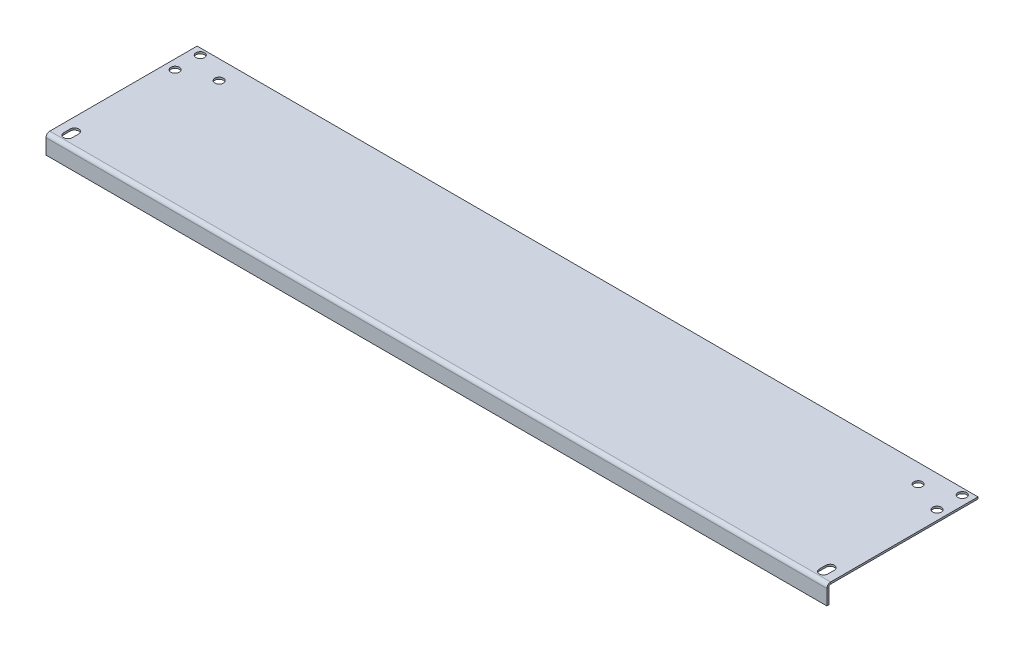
ISO-10303-21;
HEADER;
FILE_DESCRIPTION(('STEP AP214'),'2;1');
FILE_NAME('part.step','',(''),(''),'','','');
FILE_SCHEMA(('AUTOMOTIVE_DESIGN { 1 0 10303 214 1 1 1 1 }'));
ENDSEC;
DATA;
#1=APPLICATION_CONTEXT('core data for automotive mechanical design processes');
#2=APPLICATION_PROTOCOL_DEFINITION('international standard','automotive_design',2000,#1);
#3=PRODUCT_CONTEXT('',#1,'mechanical');
#4=PRODUCT('Part','Part','',(#3));
#5=PRODUCT_RELATED_PRODUCT_CATEGORY('part','',(#4));
#6=PRODUCT_DEFINITION_FORMATION('','',#4);
#7=PRODUCT_DEFINITION_CONTEXT('part definition',#1,'design');
#8=PRODUCT_DEFINITION('design','',#6,#7);
#9=PRODUCT_DEFINITION_SHAPE('','',#8);
#10=(LENGTH_UNIT() NAMED_UNIT(*) SI_UNIT(.MILLI.,.METRE.));
#11=(NAMED_UNIT(*) PLANE_ANGLE_UNIT() SI_UNIT($,.RADIAN.));
#12=(NAMED_UNIT(*) SI_UNIT($,.STERADIAN.) SOLID_ANGLE_UNIT());
#13=UNCERTAINTY_MEASURE_WITH_UNIT(LENGTH_MEASURE(1.E-05),#10,'distance_accuracy_value','');
#14=(GEOMETRIC_REPRESENTATION_CONTEXT(3) GLOBAL_UNCERTAINTY_ASSIGNED_CONTEXT((#13)) GLOBAL_UNIT_ASSIGNED_CONTEXT((#10,
#11,#12)) REPRESENTATION_CONTEXT('',''));
#15=CARTESIAN_POINT('',(0.,0.,0.));
#16=DIRECTION('',(0.,0.,1.));
#17=DIRECTION('',(1.,0.,0.));
#18=AXIS2_PLACEMENT_3D('',#15,#16,#17);
#19=CARTESIAN_POINT('',(310.,-1.5,0.));
#20=DIRECTION('',(0.,1.,0.));
#21=DIRECTION('',(0.,0.,1.));
#22=AXIS2_PLACEMENT_3D('',#19,#20,#21);
#23=PLANE('',#22);
#24=CARTESIAN_POINT('',(-302.5,-1.5,-115.));
#25=DIRECTION('',(0.,1.,0.));
#26=DIRECTION('',(0.,0.,1.));
#27=AXIS2_PLACEMENT_3D('',#24,#25,#26);
#28=CIRCLE('',#27,3.39999999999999);
#29=CARTESIAN_POINT('',(-302.5,-1.5,-111.6));
#30=VERTEX_POINT('',#29);
#31=EDGE_CURVE('E498',#30,#30,#28,.T.);
#32=ORIENTED_EDGE('',*,*,#31,.T.);
#33=EDGE_LOOP('',(#32));
#34=FACE_BOUND('',#33,.T.);
#35=CARTESIAN_POINT('',(-302.5,-1.5,-95.));
#36=DIRECTION('',(0.,1.,0.));
#37=DIRECTION('',(0.,0.,1.));
#38=AXIS2_PLACEMENT_3D('',#35,#36,#37);
#39=CIRCLE('',#38,3.39999999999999);
#40=CARTESIAN_POINT('',(-302.5,-1.5,-91.6));
#41=VERTEX_POINT('',#40);
#42=EDGE_CURVE('E505',#41,#41,#39,.T.);
#43=ORIENTED_EDGE('',*,*,#42,.T.);
#44=EDGE_LOOP('',(#43));
#45=FACE_BOUND('',#44,.T.);
#46=CARTESIAN_POINT('',(-277.5,-1.5,-105.));
#47=DIRECTION('',(0.,1.,0.));
#48=DIRECTION('',(0.,0.,1.));
#49=AXIS2_PLACEMENT_3D('',#46,#47,#48);
#50=CIRCLE('',#49,3.39999999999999);
#51=CARTESIAN_POINT('',(-277.5,-1.5,-101.6));
#52=VERTEX_POINT('',#51);
#53=EDGE_CURVE('E517',#52,#52,#50,.T.);
#54=ORIENTED_EDGE('',*,*,#53,.T.);
#55=EDGE_LOOP('',(#54));
#56=FACE_BOUND('',#55,.T.);
#57=DIRECTION('',(0.,0.,-1.));
#58=VECTOR('',#57,1.);
#59=CARTESIAN_POINT('',(-310.,-1.5,0.));
#60=LINE('',#59,#58);
#61=CARTESIAN_POINT('',(-310.,-1.5,-3.));
#62=VERTEX_POINT('',#61);
#63=CARTESIAN_POINT('',(-310.,-1.5,-120.));
#64=VERTEX_POINT('',#63);
#65=EDGE_CURVE('E262',#62,#64,#60,.T.);
#66=ORIENTED_EDGE('',*,*,#65,.T.);
#67=DIRECTION('',(-1.,0.,0.));
#68=VECTOR('',#67,1.);
#69=CARTESIAN_POINT('',(310.,-1.5,-120.));
#70=LINE('',#69,#68);
#71=CARTESIAN_POINT('',(310.,-1.5,-120.));
#72=VERTEX_POINT('',#71);
#73=EDGE_CURVE('E349',#72,#64,#70,.T.);
#74=ORIENTED_EDGE('',*,*,#73,.F.);
#75=DIRECTION('',(0.,0.,-1.));
#76=VECTOR('',#75,1.);
#77=CARTESIAN_POINT('',(310.,-1.5,0.));
#78=LINE('',#77,#76);
#79=CARTESIAN_POINT('',(310.,-1.5,-3.));
#80=VERTEX_POINT('',#79);
#81=EDGE_CURVE('E294',#80,#72,#78,.T.);
#82=ORIENTED_EDGE('',*,*,#81,.F.);
#83=DIRECTION('',(-1.,0.,0.));
#84=VECTOR('',#83,1.);
#85=CARTESIAN_POINT('',(310.,-1.5,-3.));
#86=LINE('',#85,#84);
#87=EDGE_CURVE('E324',#80,#62,#86,.T.);
#88=ORIENTED_EDGE('',*,*,#87,.T.);
#89=EDGE_LOOP('',(#66,#74,#82,#88));
#90=FACE_BOUND('',#89,.T.);
#91=DIRECTION('',(0.,0.,1.));
#92=VECTOR('',#91,1.);
#93=CARTESIAN_POINT('',(303.4,-1.5,-12.6));
#94=LINE('',#93,#92);
#95=CARTESIAN_POINT('',(303.4,-1.5,-12.6));
#96=VERTEX_POINT('',#95);
#97=CARTESIAN_POINT('',(303.4,-1.5,-7.39999999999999));
#98=VERTEX_POINT('',#97);
#99=EDGE_CURVE('E223',#96,#98,#94,.T.);
#100=ORIENTED_EDGE('',*,*,#99,.F.);
#101=CARTESIAN_POINT('',(300.,-1.5,-12.6));
#102=DIRECTION('',(0.,1.,0.));
#103=DIRECTION('',(0.,0.,1.));
#104=AXIS2_PLACEMENT_3D('',#101,#102,#103);
#105=CIRCLE('',#104,3.40000000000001);
#106=CARTESIAN_POINT('',(296.6,-1.5,-12.6));
#107=VERTEX_POINT('',#106);
#108=EDGE_CURVE('E227',#107,#96,#105,.F.);
#109=ORIENTED_EDGE('',*,*,#108,.F.);
#110=DIRECTION('',(0.,0.,-1.));
#111=VECTOR('',#110,1.);
#112=CARTESIAN_POINT('',(296.6,-1.5,-12.6));
#113=LINE('',#112,#111);
#114=CARTESIAN_POINT('',(296.6,-1.5,-7.39999999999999));
#115=VERTEX_POINT('',#114);
#116=EDGE_CURVE('E250',#115,#107,#113,.T.);
#117=ORIENTED_EDGE('',*,*,#116,.F.);
#118=CARTESIAN_POINT('',(300.,-1.5,-7.39999999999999));
#119=DIRECTION('',(0.,1.,0.));
#120=DIRECTION('',(0.,0.,1.));
#121=AXIS2_PLACEMENT_3D('',#118,#119,#120);
#122=CIRCLE('',#121,3.40000000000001);
#123=EDGE_CURVE('E220',#98,#115,#122,.F.);
#124=ORIENTED_EDGE('',*,*,#123,.F.);
#125=EDGE_LOOP('',(#100,#109,#117,#124));
#126=FACE_BOUND('',#125,.T.);
#127=CARTESIAN_POINT('',(277.5,-1.5,-105.));
#128=DIRECTION('',(0.,1.,0.));
#129=DIRECTION('',(0.,0.,1.));
#130=AXIS2_PLACEMENT_3D('',#127,#128,#129);
#131=CIRCLE('',#130,3.39999999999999);
#132=CARTESIAN_POINT('',(277.5,-1.5,-101.6));
#133=VERTEX_POINT('',#132);
#134=EDGE_CURVE('E216',#133,#133,#131,.T.);
#135=ORIENTED_EDGE('',*,*,#134,.T.);
#136=EDGE_LOOP('',(#135));
#137=FACE_BOUND('',#136,.T.);
#138=CARTESIAN_POINT('',(302.5,-1.5,-95.));
#139=DIRECTION('',(0.,1.,0.));
#140=DIRECTION('',(0.,0.,1.));
#141=AXIS2_PLACEMENT_3D('',#138,#139,#140);
#142=CIRCLE('',#141,3.39999999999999);
#143=CARTESIAN_POINT('',(302.5,-1.5,-91.6));
#144=VERTEX_POINT('',#143);
#145=EDGE_CURVE('E208',#144,#144,#142,.T.);
#146=ORIENTED_EDGE('',*,*,#145,.T.);
#147=EDGE_LOOP('',(#146));
#148=FACE_BOUND('',#147,.T.);
#149=CARTESIAN_POINT('',(302.5,-1.5,-115.));
#150=DIRECTION('',(0.,1.,0.));
#151=DIRECTION('',(0.,0.,1.));
#152=AXIS2_PLACEMENT_3D('',#149,#150,#151);
#153=CIRCLE('',#152,3.39999999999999);
#154=CARTESIAN_POINT('',(302.5,-1.5,-111.6));
#155=VERTEX_POINT('',#154);
#156=EDGE_CURVE('E200',#155,#155,#153,.T.);
#157=ORIENTED_EDGE('',*,*,#156,.T.);
#158=EDGE_LOOP('',(#157));
#159=FACE_BOUND('',#158,.T.);
#160=CARTESIAN_POINT('',(-300.,-1.5,-12.6));
#161=DIRECTION('',(0.,1.,0.));
#162=DIRECTION('',(0.,0.,1.));
#163=AXIS2_PLACEMENT_3D('',#160,#161,#162);
#164=CIRCLE('',#163,3.40000000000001);
#165=CARTESIAN_POINT('',(-296.6,-1.5,-12.6));
#166=VERTEX_POINT('',#165);
#167=CARTESIAN_POINT('',(-303.4,-1.5,-12.6));
#168=VERTEX_POINT('',#167);
#169=EDGE_CURVE('E162',#166,#168,#164,.T.);
#170=ORIENTED_EDGE('',*,*,#169,.T.);
#171=DIRECTION('',(0.,0.,1.));
#172=VECTOR('',#171,1.);
#173=CARTESIAN_POINT('',(-303.4,-1.5,-12.6));
#174=LINE('',#173,#172);
#175=CARTESIAN_POINT('',(-303.4,-1.5,-7.39999999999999));
#176=VERTEX_POINT('',#175);
#177=EDGE_CURVE('E150',#168,#176,#174,.T.);
#178=ORIENTED_EDGE('',*,*,#177,.T.);
#179=CARTESIAN_POINT('',(-300.,-1.5,-7.39999999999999));
#180=DIRECTION('',(0.,1.,0.));
#181=DIRECTION('',(0.,0.,1.));
#182=AXIS2_PLACEMENT_3D('',#179,#180,#181);
#183=CIRCLE('',#182,3.40000000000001);
#184=CARTESIAN_POINT('',(-296.6,-1.5,-7.39999999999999));
#185=VERTEX_POINT('',#184);
#186=EDGE_CURVE('E177',#176,#185,#183,.T.);
#187=ORIENTED_EDGE('',*,*,#186,.T.);
#188=DIRECTION('',(0.,0.,-1.));
#189=VECTOR('',#188,1.);
#190=CARTESIAN_POINT('',(-296.6,-1.5,-12.6));
#191=LINE('',#190,#189);
#192=EDGE_CURVE('E168',#185,#166,#191,.T.);
#193=ORIENTED_EDGE('',*,*,#192,.T.);
#194=EDGE_LOOP('',(#170,#178,#187,#193));
#195=FACE_BOUND('',#194,.T.);
#196=ADVANCED_FACE('F38',(#34,#45,#56,#90,#126,#137,#148,#159,#195),#23,.F.);
#197=CARTESIAN_POINT('',(310.,0.,0.));
#198=DIRECTION('',(0.,1.,0.));
#199=DIRECTION('',(0.,0.,1.));
#200=AXIS2_PLACEMENT_3D('',#197,#198,#199);
#201=PLANE('',#200);
#202=CARTESIAN_POINT('',(-302.5,0.,-115.));
#203=DIRECTION('',(0.,1.,0.));
#204=DIRECTION('',(0.,0.,1.));
#205=AXIS2_PLACEMENT_3D('',#202,#203,#204);
#206=CIRCLE('',#205,3.40000000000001);
#207=CARTESIAN_POINT('',(-302.5,0.,-111.6));
#208=VERTEX_POINT('',#207);
#209=EDGE_CURVE('E496',#208,#208,#206,.T.);
#210=ORIENTED_EDGE('',*,*,#209,.F.);
#211=EDGE_LOOP('',(#210));
#212=FACE_BOUND('',#211,.T.);
#213=CARTESIAN_POINT('',(-302.5,0.,-95.));
#214=DIRECTION('',(0.,1.,0.));
#215=DIRECTION('',(0.,0.,1.));
#216=AXIS2_PLACEMENT_3D('',#213,#214,#215);
#217=CIRCLE('',#216,3.40000000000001);
#218=CARTESIAN_POINT('',(-302.5,0.,-91.6));
#219=VERTEX_POINT('',#218);
#220=EDGE_CURVE('E500',#219,#219,#217,.T.);
#221=ORIENTED_EDGE('',*,*,#220,.F.);
#222=EDGE_LOOP('',(#221));
#223=FACE_BOUND('',#222,.T.);
#224=CARTESIAN_POINT('',(-277.5,0.,-105.));
#225=DIRECTION('',(0.,1.,0.));
#226=DIRECTION('',(0.,0.,1.));
#227=AXIS2_PLACEMENT_3D('',#224,#225,#226);
#228=CIRCLE('',#227,3.40000000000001);
#229=CARTESIAN_POINT('',(-277.5,0.,-101.6));
#230=VERTEX_POINT('',#229);
#231=EDGE_CURVE('E513',#230,#230,#228,.T.);
#232=ORIENTED_EDGE('',*,*,#231,.F.);
#233=EDGE_LOOP('',(#232));
#234=FACE_BOUND('',#233,.T.);
#235=DIRECTION('',(0.,0.,-1.));
#236=VECTOR('',#235,1.);
#237=CARTESIAN_POINT('',(-310.,0.,0.));
#238=LINE('',#237,#236);
#239=CARTESIAN_POINT('',(-310.,0.,-3.));
#240=VERTEX_POINT('',#239);
#241=CARTESIAN_POINT('',(-310.,0.,-120.));
#242=VERTEX_POINT('',#241);
#243=EDGE_CURVE('E270',#240,#242,#238,.T.);
#244=ORIENTED_EDGE('',*,*,#243,.F.);
#245=DIRECTION('',(-1.,0.,0.));
#246=VECTOR('',#245,1.);
#247=CARTESIAN_POINT('',(310.,0.,-3.));
#248=LINE('',#247,#246);
#249=CARTESIAN_POINT('',(310.,0.,-3.));
#250=VERTEX_POINT('',#249);
#251=EDGE_CURVE('E342',#250,#240,#248,.T.);
#252=ORIENTED_EDGE('',*,*,#251,.F.);
#253=DIRECTION('',(0.,0.,-1.));
#254=VECTOR('',#253,1.);
#255=CARTESIAN_POINT('',(310.,0.,0.));
#256=LINE('',#255,#254);
#257=CARTESIAN_POINT('',(310.,0.,-120.));
#258=VERTEX_POINT('',#257);
#259=EDGE_CURVE('E301',#250,#258,#256,.T.);
#260=ORIENTED_EDGE('',*,*,#259,.T.);
#261=DIRECTION('',(-1.,0.,0.));
#262=VECTOR('',#261,1.);
#263=CARTESIAN_POINT('',(310.,0.,-120.));
#264=LINE('',#263,#262);
#265=EDGE_CURVE('E346',#258,#242,#264,.T.);
#266=ORIENTED_EDGE('',*,*,#265,.T.);
#267=EDGE_LOOP('',(#244,#252,#260,#266));
#268=FACE_BOUND('',#267,.T.);
#269=CARTESIAN_POINT('',(300.,0.,-12.6));
#270=DIRECTION('',(0.,1.,0.));
#271=DIRECTION('',(0.,0.,-1.));
#272=AXIS2_PLACEMENT_3D('',#269,#270,#271);
#273=CIRCLE('',#272,3.40000000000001);
#274=CARTESIAN_POINT('',(303.4,0.,-12.6));
#275=VERTEX_POINT('',#274);
#276=CARTESIAN_POINT('',(296.6,0.,-12.6));
#277=VERTEX_POINT('',#276);
#278=EDGE_CURVE('E231',#275,#277,#273,.T.);
#279=ORIENTED_EDGE('',*,*,#278,.F.);
#280=DIRECTION('',(0.,0.,-1.));
#281=VECTOR('',#280,1.);
#282=CARTESIAN_POINT('',(303.4,0.,-12.6));
#283=LINE('',#282,#281);
#284=CARTESIAN_POINT('',(303.4,0.,-7.39999999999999));
#285=VERTEX_POINT('',#284);
#286=EDGE_CURVE('E242',#285,#275,#283,.T.);
#287=ORIENTED_EDGE('',*,*,#286,.F.);
#288=CARTESIAN_POINT('',(300.,0.,-7.39999999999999));
#289=DIRECTION('',(0.,1.,0.));
#290=DIRECTION('',(0.,0.,1.));
#291=AXIS2_PLACEMENT_3D('',#288,#289,#290);
#292=CIRCLE('',#291,3.40000000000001);
#293=CARTESIAN_POINT('',(296.6,0.,-7.39999999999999));
#294=VERTEX_POINT('',#293);
#295=EDGE_CURVE('E238',#294,#285,#292,.T.);
#296=ORIENTED_EDGE('',*,*,#295,.F.);
#297=DIRECTION('',(0.,0.,1.));
#298=VECTOR('',#297,1.);
#299=CARTESIAN_POINT('',(296.6,0.,-12.6));
#300=LINE('',#299,#298);
#301=EDGE_CURVE('E234',#277,#294,#300,.T.);
#302=ORIENTED_EDGE('',*,*,#301,.F.);
#303=EDGE_LOOP('',(#279,#287,#296,#302));
#304=FACE_BOUND('',#303,.T.);
#305=CARTESIAN_POINT('',(277.5,0.,-105.));
#306=DIRECTION('',(0.,1.,0.));
#307=DIRECTION('',(0.,0.,1.));
#308=AXIS2_PLACEMENT_3D('',#305,#306,#307);
#309=CIRCLE('',#308,3.40000000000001);
#310=CARTESIAN_POINT('',(277.5,0.,-101.6));
#311=VERTEX_POINT('',#310);
#312=EDGE_CURVE('E212',#311,#311,#309,.T.);
#313=ORIENTED_EDGE('',*,*,#312,.F.);
#314=EDGE_LOOP('',(#313));
#315=FACE_BOUND('',#314,.T.);
#316=CARTESIAN_POINT('',(302.5,0.,-95.));
#317=DIRECTION('',(0.,1.,0.));
#318=DIRECTION('',(0.,0.,1.));
#319=AXIS2_PLACEMENT_3D('',#316,#317,#318);
#320=CIRCLE('',#319,3.40000000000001);
#321=CARTESIAN_POINT('',(302.5,0.,-91.6));
#322=VERTEX_POINT('',#321);
#323=EDGE_CURVE('E204',#322,#322,#320,.T.);
#324=ORIENTED_EDGE('',*,*,#323,.F.);
#325=EDGE_LOOP('',(#324));
#326=FACE_BOUND('',#325,.T.);
#327=CARTESIAN_POINT('',(302.5,0.,-115.));
#328=DIRECTION('',(0.,1.,0.));
#329=DIRECTION('',(0.,0.,1.));
#330=AXIS2_PLACEMENT_3D('',#327,#328,#329);
#331=CIRCLE('',#330,3.40000000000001);
#332=CARTESIAN_POINT('',(302.5,0.,-111.6));
#333=VERTEX_POINT('',#332);
#334=EDGE_CURVE('E158',#333,#333,#331,.T.);
#335=ORIENTED_EDGE('',*,*,#334,.F.);
#336=EDGE_LOOP('',(#335));
#337=FACE_BOUND('',#336,.T.);
#338=DIRECTION('',(0.,0.,-1.));
#339=VECTOR('',#338,1.);
#340=CARTESIAN_POINT('',(-303.4,0.,-12.6));
#341=LINE('',#340,#339);
#342=CARTESIAN_POINT('',(-303.4,0.,-7.39999999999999));
#343=VERTEX_POINT('',#342);
#344=CARTESIAN_POINT('',(-303.4,0.,-12.6));
#345=VERTEX_POINT('',#344);
#346=EDGE_CURVE('E174',#343,#345,#341,.T.);
#347=ORIENTED_EDGE('',*,*,#346,.T.);
#348=CARTESIAN_POINT('',(-300.,0.,-12.6));
#349=DIRECTION('',(0.,-1.,0.));
#350=DIRECTION('',(0.,0.,-1.));
#351=AXIS2_PLACEMENT_3D('',#348,#349,#350);
#352=CIRCLE('',#351,3.40000000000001);
#353=CARTESIAN_POINT('',(-296.6,0.,-12.6));
#354=VERTEX_POINT('',#353);
#355=EDGE_CURVE('E62',#345,#354,#352,.T.);
#356=ORIENTED_EDGE('',*,*,#355,.T.);
#357=DIRECTION('',(0.,0.,1.));
#358=VECTOR('',#357,1.);
#359=CARTESIAN_POINT('',(-296.6,0.,-12.6));
#360=LINE('',#359,#358);
#361=CARTESIAN_POINT('',(-296.6,0.,-7.39999999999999));
#362=VERTEX_POINT('',#361);
#363=EDGE_CURVE('E165',#354,#362,#360,.T.);
#364=ORIENTED_EDGE('',*,*,#363,.T.);
#365=CARTESIAN_POINT('',(-300.,0.,-7.39999999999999));
#366=DIRECTION('',(0.,-1.,0.));
#367=DIRECTION('',(0.,0.,1.));
#368=AXIS2_PLACEMENT_3D('',#365,#366,#367);
#369=CIRCLE('',#368,3.40000000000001);
#370=EDGE_CURVE('E183',#362,#343,#369,.T.);
#371=ORIENTED_EDGE('',*,*,#370,.T.);
#372=EDGE_LOOP('',(#347,#356,#364,#371));
#373=FACE_BOUND('',#372,.T.);
#374=ADVANCED_FACE('F396',(#212,#223,#234,#268,#304,#315,#326,#337,#373),#201,.T.);
#375=CARTESIAN_POINT('',(310.,0.,-3.));
#376=DIRECTION('',(1.,0.,0.));
#377=DIRECTION('',(0.,0.,-1.));
#378=AXIS2_PLACEMENT_3D('',#375,#376,#377);
#379=PLANE('',#378);
#380=DIRECTION('',(0.,-1.,0.));
#381=VECTOR('',#380,1.);
#382=CARTESIAN_POINT('',(310.,0.,-3.));
#383=LINE('',#382,#381);
#384=EDGE_CURVE('E11',#250,#80,#383,.T.);
#385=ORIENTED_EDGE('',*,*,#384,.F.);
#386=CARTESIAN_POINT('',(310.,-3.,-3.));
#387=DIRECTION('',(1.,0.,0.));
#388=DIRECTION('',(0.,0.,-1.));
#389=AXIS2_PLACEMENT_3D('',#386,#387,#388);
#390=CIRCLE('',#389,3.);
#391=CARTESIAN_POINT('',(310.,-3.,0.));
#392=VERTEX_POINT('',#391);
#393=EDGE_CURVE('E305',#392,#250,#390,.F.);
#394=ORIENTED_EDGE('',*,*,#393,.F.);
#395=DIRECTION('',(0.,0.,1.));
#396=VECTOR('',#395,1.);
#397=CARTESIAN_POINT('',(310.,-3.,-1.5));
#398=LINE('',#397,#396);
#399=CARTESIAN_POINT('',(310.,-3.,-1.5));
#400=VERTEX_POINT('',#399);
#401=EDGE_CURVE('E47',#400,#392,#398,.T.);
#402=ORIENTED_EDGE('',*,*,#401,.F.);
#403=CARTESIAN_POINT('',(310.,-3.,-3.));
#404=DIRECTION('',(1.,0.,0.));
#405=DIRECTION('',(0.,0.,-1.));
#406=AXIS2_PLACEMENT_3D('',#403,#404,#405);
#407=CIRCLE('',#406,1.5);
#408=EDGE_CURVE('E320',#400,#80,#407,.F.);
#409=ORIENTED_EDGE('',*,*,#408,.T.);
#410=EDGE_LOOP('',(#385,#394,#402,#409));
#411=FACE_BOUND('',#410,.T.);
#412=ADVANCED_FACE('F40',(#411),#379,.T.);
#413=CARTESIAN_POINT('',(310.,-3.,-1.5));
#414=DIRECTION('',(1.,0.,0.));
#415=DIRECTION('',(0.,0.,-1.));
#416=AXIS2_PLACEMENT_3D('',#413,#414,#415);
#417=PLANE('',#416);
#418=ORIENTED_EDGE('',*,*,#259,.F.);
#419=ORIENTED_EDGE('',*,*,#384,.T.);
#420=ORIENTED_EDGE('',*,*,#81,.T.);
#421=DIRECTION('',(0.,-1.,0.));
#422=VECTOR('',#421,1.);
#423=CARTESIAN_POINT('',(310.,0.,-120.));
#424=LINE('',#423,#422);
#425=EDGE_CURVE('E297',#258,#72,#424,.T.);
#426=ORIENTED_EDGE('',*,*,#425,.F.);
#427=EDGE_LOOP('',(#418,#419,#420,#426));
#428=FACE_BOUND('',#427,.T.);
#429=ADVANCED_FACE('F393',(#428),#417,.T.);
#430=CARTESIAN_POINT('',(-310.,-3.,0.));
#431=DIRECTION('',(-1.,0.,0.));
#432=DIRECTION('',(0.,0.,1.));
#433=AXIS2_PLACEMENT_3D('',#430,#431,#432);
#434=PLANE('',#433);
#435=DIRECTION('',(0.,0.,-1.));
#436=VECTOR('',#435,1.);
#437=CARTESIAN_POINT('',(-310.,-3.,0.));
#438=LINE('',#437,#436);
#439=CARTESIAN_POINT('',(-310.,-3.,0.));
#440=VERTEX_POINT('',#439);
#441=CARTESIAN_POINT('',(-310.,-3.,-1.5));
#442=VERTEX_POINT('',#441);
#443=EDGE_CURVE('E355',#440,#442,#438,.T.);
#444=ORIENTED_EDGE('',*,*,#443,.F.);
#445=CARTESIAN_POINT('',(-310.,-3.,-3.));
#446=DIRECTION('',(1.,0.,0.));
#447=DIRECTION('',(0.,0.,-1.));
#448=AXIS2_PLACEMENT_3D('',#445,#446,#447);
#449=CIRCLE('',#448,3.);
#450=EDGE_CURVE('E274',#440,#240,#449,.F.);
#451=ORIENTED_EDGE('',*,*,#450,.T.);
#452=DIRECTION('',(0.,1.,0.));
#453=VECTOR('',#452,1.);
#454=CARTESIAN_POINT('',(-310.,-1.5,-3.));
#455=LINE('',#454,#453);
#456=EDGE_CURVE('E352',#62,#240,#455,.T.);
#457=ORIENTED_EDGE('',*,*,#456,.F.);
#458=CARTESIAN_POINT('',(-310.,-3.,-3.));
#459=DIRECTION('',(1.,0.,0.));
#460=DIRECTION('',(0.,0.,-1.));
#461=AXIS2_PLACEMENT_3D('',#458,#459,#460);
#462=CIRCLE('',#461,1.5);
#463=EDGE_CURVE('E290',#442,#62,#462,.F.);
#464=ORIENTED_EDGE('',*,*,#463,.F.);
#465=EDGE_LOOP('',(#444,#451,#457,#464));
#466=FACE_BOUND('',#465,.T.);
#467=ADVANCED_FACE('F401',(#466),#434,.T.);
#468=CARTESIAN_POINT('',(-310.,-1.5,-3.));
#469=DIRECTION('',(-1.,0.,0.));
#470=DIRECTION('',(0.,0.,1.));
#471=AXIS2_PLACEMENT_3D('',#468,#469,#470);
#472=PLANE('',#471);
#473=DIRECTION('',(0.,1.,0.));
#474=VECTOR('',#473,1.);
#475=CARTESIAN_POINT('',(-310.,-15.,0.));
#476=LINE('',#475,#474);
#477=CARTESIAN_POINT('',(-310.,-15.,0.));
#478=VERTEX_POINT('',#477);
#479=EDGE_CURVE('E278',#478,#440,#476,.T.);
#480=ORIENTED_EDGE('',*,*,#479,.T.);
#481=ORIENTED_EDGE('',*,*,#443,.T.);
#482=DIRECTION('',(0.,1.,0.));
#483=VECTOR('',#482,1.);
#484=CARTESIAN_POINT('',(-310.,-15.,-1.5));
#485=LINE('',#484,#483);
#486=CARTESIAN_POINT('',(-310.,-15.,-1.5));
#487=VERTEX_POINT('',#486);
#488=EDGE_CURVE('E286',#487,#442,#485,.T.);
#489=ORIENTED_EDGE('',*,*,#488,.F.);
#490=DIRECTION('',(0.,0.,1.));
#491=VECTOR('',#490,1.);
#492=CARTESIAN_POINT('',(-310.,-15.,-1.5));
#493=LINE('',#492,#491);
#494=EDGE_CURVE('E282',#487,#478,#493,.T.);
#495=ORIENTED_EDGE('',*,*,#494,.T.);
#496=EDGE_LOOP('',(#480,#481,#489,#495));
#497=FACE_BOUND('',#496,.T.);
#498=ADVANCED_FACE('F403',(#497),#472,.T.);
#499=CARTESIAN_POINT('',(310.,0.,-120.));
#500=DIRECTION('',(0.,0.,-1.));
#501=DIRECTION('',(-1.,0.,0.));
#502=AXIS2_PLACEMENT_3D('',#499,#500,#501);
#503=PLANE('',#502);
#504=DIRECTION('',(0.,-1.,0.));
#505=VECTOR('',#504,1.);
#506=CARTESIAN_POINT('',(-310.,0.,-120.));
#507=LINE('',#506,#505);
#508=EDGE_CURVE('E266',#242,#64,#507,.T.);
#509=ORIENTED_EDGE('',*,*,#508,.F.);
#510=ORIENTED_EDGE('',*,*,#265,.F.);
#511=ORIENTED_EDGE('',*,*,#425,.T.);
#512=ORIENTED_EDGE('',*,*,#73,.T.);
#513=EDGE_LOOP('',(#509,#510,#511,#512));
#514=FACE_BOUND('',#513,.T.);
#515=ADVANCED_FACE('F405',(#514),#503,.T.);
#516=CARTESIAN_POINT('',(310.,-3.,-3.));
#517=DIRECTION('',(-1.,0.,0.));
#518=DIRECTION('',(0.,0.,1.));
#519=AXIS2_PLACEMENT_3D('',#516,#517,#518);
#520=CYLINDRICAL_SURFACE('',#519,3.);
#521=ORIENTED_EDGE('',*,*,#450,.F.);
#522=DIRECTION('',(-1.,0.,0.));
#523=VECTOR('',#522,1.);
#524=CARTESIAN_POINT('',(310.,-3.,0.));
#525=LINE('',#524,#523);
#526=EDGE_CURVE('E338',#392,#440,#525,.T.);
#527=ORIENTED_EDGE('',*,*,#526,.F.);
#528=ORIENTED_EDGE('',*,*,#393,.T.);
#529=ORIENTED_EDGE('',*,*,#251,.T.);
#530=EDGE_LOOP('',(#521,#527,#528,#529));
#531=FACE_BOUND('',#530,.T.);
#532=ADVANCED_FACE('F369',(#531),#520,.T.);
#533=CARTESIAN_POINT('',(310.,-15.,0.));
#534=DIRECTION('',(0.,0.,1.));
#535=DIRECTION('',(1.,0.,0.));
#536=AXIS2_PLACEMENT_3D('',#533,#534,#535);
#537=PLANE('',#536);
#538=ORIENTED_EDGE('',*,*,#479,.F.);
#539=DIRECTION('',(-1.,0.,0.));
#540=VECTOR('',#539,1.);
#541=CARTESIAN_POINT('',(310.,-15.,0.));
#542=LINE('',#541,#540);
#543=CARTESIAN_POINT('',(310.,-15.,0.));
#544=VERTEX_POINT('',#543);
#545=EDGE_CURVE('E335',#544,#478,#542,.T.);
#546=ORIENTED_EDGE('',*,*,#545,.F.);
#547=DIRECTION('',(0.,1.,0.));
#548=VECTOR('',#547,1.);
#549=CARTESIAN_POINT('',(310.,-15.,0.));
#550=LINE('',#549,#548);
#551=EDGE_CURVE('E308',#544,#392,#550,.T.);
#552=ORIENTED_EDGE('',*,*,#551,.T.);
#553=ORIENTED_EDGE('',*,*,#526,.T.);
#554=EDGE_LOOP('',(#538,#546,#552,#553));
#555=FACE_BOUND('',#554,.T.);
#556=ADVANCED_FACE('F373',(#555),#537,.T.);
#557=CARTESIAN_POINT('',(310.,-15.,-1.5));
#558=DIRECTION('',(0.,-1.,0.));
#559=DIRECTION('',(0.,0.,-1.));
#560=AXIS2_PLACEMENT_3D('',#557,#558,#559);
#561=PLANE('',#560);
#562=ORIENTED_EDGE('',*,*,#494,.F.);
#563=DIRECTION('',(-1.,0.,0.));
#564=VECTOR('',#563,1.);
#565=CARTESIAN_POINT('',(310.,-15.,-1.5));
#566=LINE('',#565,#564);
#567=CARTESIAN_POINT('',(310.,-15.,-1.5));
#568=VERTEX_POINT('',#567);
#569=EDGE_CURVE('E332',#568,#487,#566,.T.);
#570=ORIENTED_EDGE('',*,*,#569,.F.);
#571=DIRECTION('',(0.,0.,1.));
#572=VECTOR('',#571,1.);
#573=CARTESIAN_POINT('',(310.,-15.,-1.5));
#574=LINE('',#573,#572);
#575=EDGE_CURVE('E312',#568,#544,#574,.T.);
#576=ORIENTED_EDGE('',*,*,#575,.T.);
#577=ORIENTED_EDGE('',*,*,#545,.T.);
#578=EDGE_LOOP('',(#562,#570,#576,#577));
#579=FACE_BOUND('',#578,.T.);
#580=ADVANCED_FACE('F376',(#579),#561,.T.);
#581=CARTESIAN_POINT('',(310.,-15.,-1.5));
#582=DIRECTION('',(0.,0.,1.));
#583=DIRECTION('',(1.,0.,0.));
#584=AXIS2_PLACEMENT_3D('',#581,#582,#583);
#585=PLANE('',#584);
#586=ORIENTED_EDGE('',*,*,#488,.T.);
#587=DIRECTION('',(-1.,0.,0.));
#588=VECTOR('',#587,1.);
#589=CARTESIAN_POINT('',(310.,-3.,-1.5));
#590=LINE('',#589,#588);
#591=EDGE_CURVE('E328',#400,#442,#590,.T.);
#592=ORIENTED_EDGE('',*,*,#591,.F.);
#593=DIRECTION('',(0.,1.,0.));
#594=VECTOR('',#593,1.);
#595=CARTESIAN_POINT('',(310.,-15.,-1.5));
#596=LINE('',#595,#594);
#597=EDGE_CURVE('E316',#568,#400,#596,.T.);
#598=ORIENTED_EDGE('',*,*,#597,.F.);
#599=ORIENTED_EDGE('',*,*,#569,.T.);
#600=EDGE_LOOP('',(#586,#592,#598,#599));
#601=FACE_BOUND('',#600,.T.);
#602=ADVANCED_FACE('F379',(#601),#585,.F.);
#603=CARTESIAN_POINT('',(310.,-3.,-3.));
#604=DIRECTION('',(-1.,0.,0.));
#605=DIRECTION('',(0.,0.,1.));
#606=AXIS2_PLACEMENT_3D('',#603,#604,#605);
#607=CYLINDRICAL_SURFACE('',#606,1.5);
#608=ORIENTED_EDGE('',*,*,#463,.T.);
#609=ORIENTED_EDGE('',*,*,#87,.F.);
#610=ORIENTED_EDGE('',*,*,#408,.F.);
#611=ORIENTED_EDGE('',*,*,#591,.T.);
#612=EDGE_LOOP('',(#608,#609,#610,#611));
#613=FACE_BOUND('',#612,.T.);
#614=ADVANCED_FACE('F384',(#613),#607,.F.);
#615=CARTESIAN_POINT('',(310.,-3.,-3.));
#616=DIRECTION('',(1.,0.,0.));
#617=DIRECTION('',(0.,0.,-1.));
#618=AXIS2_PLACEMENT_3D('',#615,#616,#617);
#619=PLANE('',#618);
#620=ORIENTED_EDGE('',*,*,#597,.T.);
#621=ORIENTED_EDGE('',*,*,#401,.T.);
#622=ORIENTED_EDGE('',*,*,#551,.F.);
#623=ORIENTED_EDGE('',*,*,#575,.F.);
#624=EDGE_LOOP('',(#620,#621,#622,#623));
#625=FACE_BOUND('',#624,.T.);
#626=ADVANCED_FACE('F361',(#625),#619,.T.);
#627=CARTESIAN_POINT('',(-310.,-3.,-3.));
#628=DIRECTION('',(1.,0.,0.));
#629=DIRECTION('',(0.,0.,-1.));
#630=AXIS2_PLACEMENT_3D('',#627,#628,#629);
#631=PLANE('',#630);
#632=ORIENTED_EDGE('',*,*,#65,.F.);
#633=ORIENTED_EDGE('',*,*,#456,.T.);
#634=ORIENTED_EDGE('',*,*,#243,.T.);
#635=ORIENTED_EDGE('',*,*,#508,.T.);
#636=EDGE_LOOP('',(#632,#633,#634,#635));
#637=FACE_BOUND('',#636,.T.);
#638=ADVANCED_FACE('F437',(#637),#631,.F.);
#639=CARTESIAN_POINT('',(300.,-15.001,-12.6));
#640=DIRECTION('',(0.,1.,0.));
#641=DIRECTION('',(0.,0.,1.));
#642=AXIS2_PLACEMENT_3D('',#639,#640,#641);
#643=CYLINDRICAL_SURFACE('',#642,3.40000000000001);
#644=ORIENTED_EDGE('',*,*,#108,.T.);
#645=DIRECTION('',(0.,1.,0.));
#646=VECTOR('',#645,1.);
#647=CARTESIAN_POINT('',(303.4,-15.001,-12.6));
#648=LINE('',#647,#646);
#649=EDGE_CURVE('E247',#96,#275,#648,.T.);
#650=ORIENTED_EDGE('',*,*,#649,.T.);
#651=ORIENTED_EDGE('',*,*,#278,.T.);
#652=DIRECTION('',(0.,1.,0.));
#653=VECTOR('',#652,1.);
#654=CARTESIAN_POINT('',(296.6,-15.001,-12.6));
#655=LINE('',#654,#653);
#656=EDGE_CURVE('E246',#107,#277,#655,.T.);
#657=ORIENTED_EDGE('',*,*,#656,.F.);
#658=EDGE_LOOP('',(#644,#650,#651,#657));
#659=FACE_BOUND('',#658,.T.);
#660=ADVANCED_FACE('F440',(#659),#643,.F.);
#661=CARTESIAN_POINT('',(303.4,-15.001,-12.6));
#662=DIRECTION('',(1.,0.,0.));
#663=DIRECTION('',(0.,0.,-1.));
#664=AXIS2_PLACEMENT_3D('',#661,#662,#663);
#665=PLANE('',#664);
#666=ORIENTED_EDGE('',*,*,#99,.T.);
#667=DIRECTION('',(0.,1.,0.));
#668=VECTOR('',#667,1.);
#669=CARTESIAN_POINT('',(303.4,-15.001,-7.39999999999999));
#670=LINE('',#669,#668);
#671=EDGE_CURVE('E251',#98,#285,#670,.T.);
#672=ORIENTED_EDGE('',*,*,#671,.T.);
#673=ORIENTED_EDGE('',*,*,#286,.T.);
#674=ORIENTED_EDGE('',*,*,#649,.F.);
#675=EDGE_LOOP('',(#666,#672,#673,#674));
#676=FACE_BOUND('',#675,.T.);
#677=ADVANCED_FACE('F443',(#676),#665,.F.);
#678=CARTESIAN_POINT('',(300.,-15.001,-7.39999999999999));
#679=DIRECTION('',(0.,1.,0.));
#680=DIRECTION('',(0.,0.,1.));
#681=AXIS2_PLACEMENT_3D('',#678,#679,#680);
#682=CYLINDRICAL_SURFACE('',#681,3.40000000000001);
#683=ORIENTED_EDGE('',*,*,#123,.T.);
#684=DIRECTION('',(0.,1.,0.));
#685=VECTOR('',#684,1.);
#686=CARTESIAN_POINT('',(296.6,-15.001,-7.39999999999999));
#687=LINE('',#686,#685);
#688=EDGE_CURVE('E254',#115,#294,#687,.T.);
#689=ORIENTED_EDGE('',*,*,#688,.T.);
#690=ORIENTED_EDGE('',*,*,#295,.T.);
#691=ORIENTED_EDGE('',*,*,#671,.F.);
#692=EDGE_LOOP('',(#683,#689,#690,#691));
#693=FACE_BOUND('',#692,.T.);
#694=ADVANCED_FACE('F449',(#693),#682,.F.);
#695=CARTESIAN_POINT('',(296.6,-15.001,-12.6));
#696=DIRECTION('',(-1.,0.,0.));
#697=DIRECTION('',(0.,0.,1.));
#698=AXIS2_PLACEMENT_3D('',#695,#696,#697);
#699=PLANE('',#698);
#700=ORIENTED_EDGE('',*,*,#116,.T.);
#701=ORIENTED_EDGE('',*,*,#656,.T.);
#702=ORIENTED_EDGE('',*,*,#301,.T.);
#703=ORIENTED_EDGE('',*,*,#688,.F.);
#704=EDGE_LOOP('',(#700,#701,#702,#703));
#705=FACE_BOUND('',#704,.T.);
#706=ADVANCED_FACE('F445',(#705),#699,.F.);
#707=CARTESIAN_POINT('',(277.5,0.,-105.));
#708=DIRECTION('',(0.,1.,0.));
#709=DIRECTION('',(0.,0.,1.));
#710=AXIS2_PLACEMENT_3D('',#707,#708,#709);
#711=CYLINDRICAL_SURFACE('',#710,3.39999999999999);
#712=ORIENTED_EDGE('',*,*,#312,.T.);
#713=EDGE_LOOP('',(#712));
#714=FACE_BOUND('',#713,.T.);
#715=ORIENTED_EDGE('',*,*,#134,.F.);
#716=EDGE_LOOP('',(#715));
#717=FACE_BOUND('',#716,.T.);
#718=ADVANCED_FACE('F448',(#714,#717),#711,.F.);
#719=CARTESIAN_POINT('',(302.5,0.,-95.));
#720=DIRECTION('',(0.,1.,0.));
#721=DIRECTION('',(0.,0.,1.));
#722=AXIS2_PLACEMENT_3D('',#719,#720,#721);
#723=CYLINDRICAL_SURFACE('',#722,3.39999999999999);
#724=ORIENTED_EDGE('',*,*,#323,.T.);
#725=EDGE_LOOP('',(#724));
#726=FACE_BOUND('',#725,.T.);
#727=ORIENTED_EDGE('',*,*,#145,.F.);
#728=EDGE_LOOP('',(#727));
#729=FACE_BOUND('',#728,.T.);
#730=ADVANCED_FACE('F459',(#726,#729),#723,.F.);
#731=CARTESIAN_POINT('',(302.5,0.,-115.));
#732=DIRECTION('',(0.,1.,0.));
#733=DIRECTION('',(0.,0.,1.));
#734=AXIS2_PLACEMENT_3D('',#731,#732,#733);
#735=CYLINDRICAL_SURFACE('',#734,3.39999999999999);
#736=ORIENTED_EDGE('',*,*,#334,.T.);
#737=EDGE_LOOP('',(#736));
#738=FACE_BOUND('',#737,.T.);
#739=ORIENTED_EDGE('',*,*,#156,.F.);
#740=EDGE_LOOP('',(#739));
#741=FACE_BOUND('',#740,.T.);
#742=ADVANCED_FACE('F463',(#738,#741),#735,.F.);
#743=CARTESIAN_POINT('',(-300.,-15.001,-12.6));
#744=DIRECTION('',(0.,1.,0.));
#745=DIRECTION('',(0.,0.,1.));
#746=AXIS2_PLACEMENT_3D('',#743,#744,#745);
#747=CYLINDRICAL_SURFACE('',#746,3.40000000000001);
#748=DIRECTION('',(0.,1.,0.));
#749=VECTOR('',#748,1.);
#750=CARTESIAN_POINT('',(-296.6,-15.001,-12.6));
#751=LINE('',#750,#749);
#752=EDGE_CURVE('E159',#166,#354,#751,.T.);
#753=ORIENTED_EDGE('',*,*,#752,.T.);
#754=ORIENTED_EDGE('',*,*,#355,.F.);
#755=DIRECTION('',(0.,1.,0.));
#756=VECTOR('',#755,1.);
#757=CARTESIAN_POINT('',(-303.4,-15.001,-12.6));
#758=LINE('',#757,#756);
#759=EDGE_CURVE('E152',#168,#345,#758,.T.);
#760=ORIENTED_EDGE('',*,*,#759,.F.);
#761=ORIENTED_EDGE('',*,*,#169,.F.);
#762=EDGE_LOOP('',(#753,#754,#760,#761));
#763=FACE_BOUND('',#762,.T.);
#764=ADVANCED_FACE('F161',(#763),#747,.F.);
#765=CARTESIAN_POINT('',(-296.6,-15.001,-12.6));
#766=DIRECTION('',(-1.,0.,0.));
#767=DIRECTION('',(0.,0.,1.));
#768=AXIS2_PLACEMENT_3D('',#765,#766,#767);
#769=PLANE('',#768);
#770=DIRECTION('',(0.,1.,0.));
#771=VECTOR('',#770,1.);
#772=CARTESIAN_POINT('',(-296.6,-15.001,-7.39999999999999));
#773=LINE('',#772,#771);
#774=EDGE_CURVE('E192',#185,#362,#773,.T.);
#775=ORIENTED_EDGE('',*,*,#774,.T.);
#776=ORIENTED_EDGE('',*,*,#363,.F.);
#777=ORIENTED_EDGE('',*,*,#752,.F.);
#778=ORIENTED_EDGE('',*,*,#192,.F.);
#779=EDGE_LOOP('',(#775,#776,#777,#778));
#780=FACE_BOUND('',#779,.T.);
#781=ADVANCED_FACE('F470',(#780),#769,.T.);
#782=CARTESIAN_POINT('',(-300.,-15.001,-7.39999999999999));
#783=DIRECTION('',(0.,1.,0.));
#784=DIRECTION('',(0.,0.,1.));
#785=AXIS2_PLACEMENT_3D('',#782,#783,#784);
#786=CYLINDRICAL_SURFACE('',#785,3.40000000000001);
#787=DIRECTION('',(0.,1.,0.));
#788=VECTOR('',#787,1.);
#789=CARTESIAN_POINT('',(-303.4,-15.001,-7.39999999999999));
#790=LINE('',#789,#788);
#791=EDGE_CURVE('E54',#176,#343,#790,.T.);
#792=ORIENTED_EDGE('',*,*,#791,.T.);
#793=ORIENTED_EDGE('',*,*,#370,.F.);
#794=ORIENTED_EDGE('',*,*,#774,.F.);
#795=ORIENTED_EDGE('',*,*,#186,.F.);
#796=EDGE_LOOP('',(#792,#793,#794,#795));
#797=FACE_BOUND('',#796,.T.);
#798=ADVANCED_FACE('F474',(#797),#786,.F.);
#799=CARTESIAN_POINT('',(-303.4,-15.001,-12.6));
#800=DIRECTION('',(1.,0.,0.));
#801=DIRECTION('',(0.,0.,-1.));
#802=AXIS2_PLACEMENT_3D('',#799,#800,#801);
#803=PLANE('',#802);
#804=ORIENTED_EDGE('',*,*,#759,.T.);
#805=ORIENTED_EDGE('',*,*,#346,.F.);
#806=ORIENTED_EDGE('',*,*,#791,.F.);
#807=ORIENTED_EDGE('',*,*,#177,.F.);
#808=EDGE_LOOP('',(#804,#805,#806,#807));
#809=FACE_BOUND('',#808,.T.);
#810=ADVANCED_FACE('F151',(#809),#803,.T.);
#811=CARTESIAN_POINT('',(-277.5,0.,-105.));
#812=DIRECTION('',(0.,1.,0.));
#813=DIRECTION('',(0.,0.,1.));
#814=AXIS2_PLACEMENT_3D('',#811,#812,#813);
#815=CYLINDRICAL_SURFACE('',#814,3.39999999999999);
#816=ORIENTED_EDGE('',*,*,#231,.T.);
#817=EDGE_LOOP('',(#816));
#818=FACE_BOUND('',#817,.T.);
#819=ORIENTED_EDGE('',*,*,#53,.F.);
#820=EDGE_LOOP('',(#819));
#821=FACE_BOUND('',#820,.T.);
#822=ADVANCED_FACE('F473',(#818,#821),#815,.F.);
#823=CARTESIAN_POINT('',(-302.5,0.,-95.));
#824=DIRECTION('',(0.,1.,0.));
#825=DIRECTION('',(0.,0.,1.));
#826=AXIS2_PLACEMENT_3D('',#823,#824,#825);
#827=CYLINDRICAL_SURFACE('',#826,3.39999999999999);
#828=ORIENTED_EDGE('',*,*,#220,.T.);
#829=EDGE_LOOP('',(#828));
#830=FACE_BOUND('',#829,.T.);
#831=ORIENTED_EDGE('',*,*,#42,.F.);
#832=EDGE_LOOP('',(#831));
#833=FACE_BOUND('',#832,.T.);
#834=ADVANCED_FACE('F483',(#830,#833),#827,.F.);
#835=CARTESIAN_POINT('',(-302.5,0.,-115.));
#836=DIRECTION('',(0.,1.,0.));
#837=DIRECTION('',(0.,0.,1.));
#838=AXIS2_PLACEMENT_3D('',#835,#836,#837);
#839=CYLINDRICAL_SURFACE('',#838,3.39999999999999);
#840=ORIENTED_EDGE('',*,*,#209,.T.);
#841=EDGE_LOOP('',(#840));
#842=FACE_BOUND('',#841,.T.);
#843=ORIENTED_EDGE('',*,*,#31,.F.);
#844=EDGE_LOOP('',(#843));
#845=FACE_BOUND('',#844,.T.);
#846=ADVANCED_FACE('F487',(#842,#845),#839,.F.);
#847=CLOSED_SHELL('',(#196,#374,#412,#429,#467,#498,#515,#532,#556,#580,#602,#614,#626,#638,
#660,#677,#694,#706,#718,#730,#742,#764,#781,#798,#810,#822,#834,#846));
#848=MANIFOLD_SOLID_BREP('B2',#847);
#849=ADVANCED_BREP_SHAPE_REPRESENTATION('',(#18,#848),#14);
#850=SHAPE_DEFINITION_REPRESENTATION(#9,#849);
ENDSEC;
END-ISO-10303-21;
